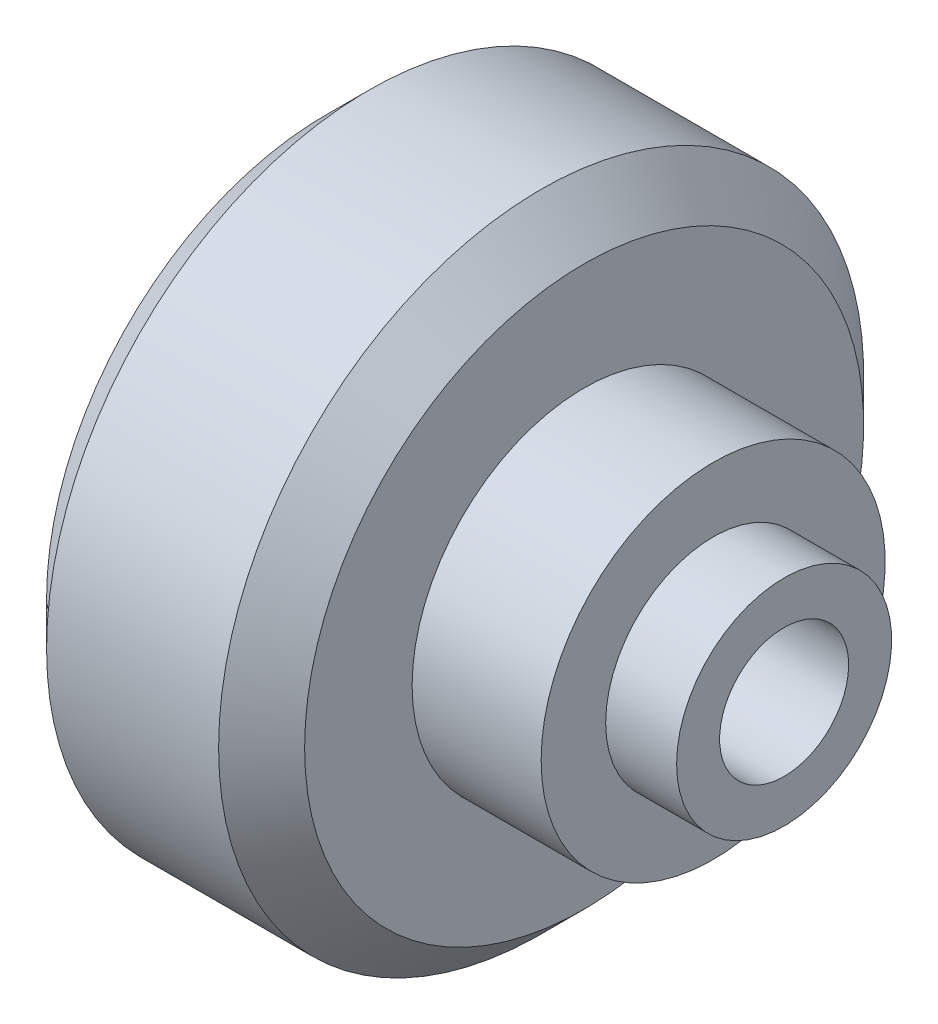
ISO-10303-21;
HEADER;
FILE_DESCRIPTION(('STEP AP214'),'2;1');
FILE_NAME('part.step','',(''),(''),'','','');
FILE_SCHEMA(('AUTOMOTIVE_DESIGN { 1 0 10303 214 1 1 1 1 }'));
ENDSEC;
DATA;
#1=APPLICATION_CONTEXT('core data for automotive mechanical design processes');
#2=APPLICATION_PROTOCOL_DEFINITION('international standard','automotive_design',2000,#1);
#3=PRODUCT_CONTEXT('',#1,'mechanical');
#4=PRODUCT('Part','Part','',(#3));
#5=PRODUCT_RELATED_PRODUCT_CATEGORY('part','',(#4));
#6=PRODUCT_DEFINITION_FORMATION('','',#4);
#7=PRODUCT_DEFINITION_CONTEXT('part definition',#1,'design');
#8=PRODUCT_DEFINITION('design','',#6,#7);
#9=PRODUCT_DEFINITION_SHAPE('','',#8);
#10=(LENGTH_UNIT() NAMED_UNIT(*) SI_UNIT(.MILLI.,.METRE.));
#11=(NAMED_UNIT(*) PLANE_ANGLE_UNIT() SI_UNIT($,.RADIAN.));
#12=(NAMED_UNIT(*) SI_UNIT($,.STERADIAN.) SOLID_ANGLE_UNIT());
#13=UNCERTAINTY_MEASURE_WITH_UNIT(LENGTH_MEASURE(1.E-05),#10,'distance_accuracy_value','');
#14=(GEOMETRIC_REPRESENTATION_CONTEXT(3) GLOBAL_UNCERTAINTY_ASSIGNED_CONTEXT((#13)) GLOBAL_UNIT_ASSIGNED_CONTEXT((#10,
#11,#12)) REPRESENTATION_CONTEXT('',''));
#15=CARTESIAN_POINT('',(0.,0.,0.));
#16=DIRECTION('',(0.,0.,1.));
#17=DIRECTION('',(1.,0.,0.));
#18=AXIS2_PLACEMENT_3D('',#15,#16,#17);
#19=CARTESIAN_POINT('',(0.,0.,0.));
#20=DIRECTION('',(1.,0.,0.));
#21=DIRECTION('',(0.,0.,-1.));
#22=AXIS2_PLACEMENT_3D('',#19,#20,#21);
#23=CYLINDRICAL_SURFACE('',#22,3.);
#24=CARTESIAN_POINT('',(21.3,0.,0.));
#25=DIRECTION('',(1.,0.,0.));
#26=DIRECTION('',(0.,0.,-1.));
#27=AXIS2_PLACEMENT_3D('',#24,#25,#26);
#28=CIRCLE('',#27,3.);
#29=CARTESIAN_POINT('',(21.3,0.,-3.));
#30=VERTEX_POINT('',#29);
#31=EDGE_CURVE('E60',#30,#30,#28,.T.);
#32=ORIENTED_EDGE('',*,*,#31,.T.);
#33=EDGE_LOOP('',(#32));
#34=FACE_BOUND('',#33,.T.);
#35=CARTESIAN_POINT('',(5.,0.,0.));
#36=DIRECTION('',(-1.,0.,0.));
#37=DIRECTION('',(0.,0.,1.));
#38=AXIS2_PLACEMENT_3D('',#35,#36,#37);
#39=CIRCLE('',#38,3.);
#40=CARTESIAN_POINT('',(5.,0.,3.));
#41=VERTEX_POINT('',#40);
#42=EDGE_CURVE('E32',#41,#41,#39,.F.);
#43=ORIENTED_EDGE('',*,*,#42,.F.);
#44=EDGE_LOOP('',(#43));
#45=FACE_BOUND('',#44,.T.);
#46=ADVANCED_FACE('F28',(#34,#45),#23,.F.);
#47=CARTESIAN_POINT('',(0.,0.,-13.));
#48=DIRECTION('',(1.,0.,0.));
#49=DIRECTION('',(0.,0.,-1.));
#50=AXIS2_PLACEMENT_3D('',#47,#48,#49);
#51=PLANE('',#50);
#52=CARTESIAN_POINT('',(0.,0.,0.));
#53=DIRECTION('',(-1.,0.,0.));
#54=DIRECTION('',(0.,0.,1.));
#55=AXIS2_PLACEMENT_3D('',#52,#53,#54);
#56=CIRCLE('',#55,8.);
#57=CARTESIAN_POINT('',(0.,0.,8.));
#58=VERTEX_POINT('',#57);
#59=EDGE_CURVE('E66',#58,#58,#56,.T.);
#60=ORIENTED_EDGE('',*,*,#59,.F.);
#61=EDGE_LOOP('',(#60));
#62=FACE_BOUND('',#61,.T.);
#63=CARTESIAN_POINT('',(0.,0.,0.));
#64=DIRECTION('',(-1.,0.,0.));
#65=DIRECTION('',(0.,0.,1.));
#66=AXIS2_PLACEMENT_3D('',#63,#64,#65);
#67=CIRCLE('',#66,13.);
#68=CARTESIAN_POINT('',(0.,0.,13.));
#69=VERTEX_POINT('',#68);
#70=EDGE_CURVE('E57',#69,#69,#67,.T.);
#71=ORIENTED_EDGE('',*,*,#70,.T.);
#72=EDGE_LOOP('',(#71));
#73=FACE_BOUND('',#72,.T.);
#74=ADVANCED_FACE('F30',(#62,#73),#51,.F.);
#75=CARTESIAN_POINT('',(21.3,0.,0.));
#76=DIRECTION('',(-1.,0.,0.));
#77=DIRECTION('',(0.,0.,1.));
#78=AXIS2_PLACEMENT_3D('',#75,#76,#77);
#79=PLANE('',#78);
#80=ORIENTED_EDGE('',*,*,#31,.F.);
#81=EDGE_LOOP('',(#80));
#82=FACE_BOUND('',#81,.T.);
#83=CARTESIAN_POINT('',(21.3,0.,0.));
#84=DIRECTION('',(-1.,0.,0.));
#85=DIRECTION('',(0.,0.,1.));
#86=AXIS2_PLACEMENT_3D('',#83,#84,#85);
#87=CIRCLE('',#86,5.);
#88=CARTESIAN_POINT('',(21.3,0.,5.));
#89=VERTEX_POINT('',#88);
#90=EDGE_CURVE('E10',#89,#89,#87,.T.);
#91=ORIENTED_EDGE('',*,*,#90,.F.);
#92=EDGE_LOOP('',(#91));
#93=FACE_BOUND('',#92,.T.);
#94=ADVANCED_FACE('F74',(#82,#93),#79,.F.);
#95=CARTESIAN_POINT('',(0.,0.,0.));
#96=DIRECTION('',(-1.,0.,0.));
#97=DIRECTION('',(0.,0.,1.));
#98=AXIS2_PLACEMENT_3D('',#95,#96,#97);
#99=CYLINDRICAL_SURFACE('',#98,5.);
#100=CARTESIAN_POINT('',(18.,0.,0.));
#101=DIRECTION('',(-1.,0.,0.));
#102=DIRECTION('',(0.,0.,1.));
#103=AXIS2_PLACEMENT_3D('',#100,#101,#102);
#104=CIRCLE('',#103,5.);
#105=CARTESIAN_POINT('',(18.,0.,5.));
#106=VERTEX_POINT('',#105);
#107=EDGE_CURVE('E36',#106,#106,#104,.T.);
#108=ORIENTED_EDGE('',*,*,#107,.F.);
#109=EDGE_LOOP('',(#108));
#110=FACE_BOUND('',#109,.T.);
#111=ORIENTED_EDGE('',*,*,#90,.T.);
#112=EDGE_LOOP('',(#111));
#113=FACE_BOUND('',#112,.T.);
#114=ADVANCED_FACE('F111',(#110,#113),#99,.T.);
#115=CARTESIAN_POINT('',(18.,0.,-5.));
#116=DIRECTION('',(-1.,0.,0.));
#117=DIRECTION('',(0.,0.,1.));
#118=AXIS2_PLACEMENT_3D('',#115,#116,#117);
#119=PLANE('',#118);
#120=CARTESIAN_POINT('',(18.,0.,0.));
#121=DIRECTION('',(-1.,0.,0.));
#122=DIRECTION('',(0.,0.,1.));
#123=AXIS2_PLACEMENT_3D('',#120,#121,#122);
#124=CIRCLE('',#123,8.);
#125=CARTESIAN_POINT('',(18.,0.,8.));
#126=VERTEX_POINT('',#125);
#127=EDGE_CURVE('E40',#126,#126,#124,.T.);
#128=ORIENTED_EDGE('',*,*,#127,.F.);
#129=EDGE_LOOP('',(#128));
#130=FACE_BOUND('',#129,.T.);
#131=ORIENTED_EDGE('',*,*,#107,.T.);
#132=EDGE_LOOP('',(#131));
#133=FACE_BOUND('',#132,.T.);
#134=ADVANCED_FACE('F105',(#130,#133),#119,.F.);
#135=CARTESIAN_POINT('',(0.,0.,0.));
#136=DIRECTION('',(-1.,0.,0.));
#137=DIRECTION('',(0.,0.,1.));
#138=AXIS2_PLACEMENT_3D('',#135,#136,#137);
#139=CYLINDRICAL_SURFACE('',#138,8.);
#140=CARTESIAN_POINT('',(12.,0.,0.));
#141=DIRECTION('',(-1.,0.,0.));
#142=DIRECTION('',(0.,0.,1.));
#143=AXIS2_PLACEMENT_3D('',#140,#141,#142);
#144=CIRCLE('',#143,8.);
#145=CARTESIAN_POINT('',(12.,0.,8.));
#146=VERTEX_POINT('',#145);
#147=EDGE_CURVE('E45',#146,#146,#144,.T.);
#148=ORIENTED_EDGE('',*,*,#147,.F.);
#149=EDGE_LOOP('',(#148));
#150=FACE_BOUND('',#149,.T.);
#151=ORIENTED_EDGE('',*,*,#127,.T.);
#152=EDGE_LOOP('',(#151));
#153=FACE_BOUND('',#152,.T.);
#154=ADVANCED_FACE('F99',(#150,#153),#139,.T.);
#155=CARTESIAN_POINT('',(12.,0.,-8.));
#156=DIRECTION('',(-1.,0.,0.));
#157=DIRECTION('',(0.,0.,1.));
#158=AXIS2_PLACEMENT_3D('',#155,#156,#157);
#159=PLANE('',#158);
#160=CARTESIAN_POINT('',(12.,0.,0.));
#161=DIRECTION('',(-1.,0.,0.));
#162=DIRECTION('',(0.,0.,1.));
#163=AXIS2_PLACEMENT_3D('',#160,#161,#162);
#164=CIRCLE('',#163,13.);
#165=CARTESIAN_POINT('',(12.,0.,13.));
#166=VERTEX_POINT('',#165);
#167=EDGE_CURVE('E48',#166,#166,#164,.T.);
#168=ORIENTED_EDGE('',*,*,#167,.F.);
#169=EDGE_LOOP('',(#168));
#170=FACE_BOUND('',#169,.T.);
#171=ORIENTED_EDGE('',*,*,#147,.T.);
#172=EDGE_LOOP('',(#171));
#173=FACE_BOUND('',#172,.T.);
#174=ADVANCED_FACE('F93',(#170,#173),#159,.F.);
#175=CARTESIAN_POINT('',(12.,0.,0.));
#176=DIRECTION('',(-1.,0.,0.));
#177=DIRECTION('',(0.,0.,1.));
#178=AXIS2_PLACEMENT_3D('',#175,#176,#177);
#179=CONICAL_SURFACE('',#178,13.,0.785398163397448);
#180=CARTESIAN_POINT('',(10.,0.,0.));
#181=DIRECTION('',(-1.,0.,0.));
#182=DIRECTION('',(0.,0.,1.));
#183=AXIS2_PLACEMENT_3D('',#180,#181,#182);
#184=CIRCLE('',#183,15.);
#185=CARTESIAN_POINT('',(10.,0.,15.));
#186=VERTEX_POINT('',#185);
#187=EDGE_CURVE('E51',#186,#186,#184,.T.);
#188=ORIENTED_EDGE('',*,*,#187,.F.);
#189=EDGE_LOOP('',(#188));
#190=FACE_BOUND('',#189,.T.);
#191=ORIENTED_EDGE('',*,*,#167,.T.);
#192=EDGE_LOOP('',(#191));
#193=FACE_BOUND('',#192,.T.);
#194=ADVANCED_FACE('F87',(#190,#193),#179,.T.);
#195=CARTESIAN_POINT('',(0.,0.,0.));
#196=DIRECTION('',(-1.,0.,0.));
#197=DIRECTION('',(0.,0.,1.));
#198=AXIS2_PLACEMENT_3D('',#195,#196,#197);
#199=CYLINDRICAL_SURFACE('',#198,15.);
#200=CARTESIAN_POINT('',(2.,0.,0.));
#201=DIRECTION('',(-1.,0.,0.));
#202=DIRECTION('',(0.,0.,1.));
#203=AXIS2_PLACEMENT_3D('',#200,#201,#202);
#204=CIRCLE('',#203,15.);
#205=CARTESIAN_POINT('',(2.,0.,15.));
#206=VERTEX_POINT('',#205);
#207=EDGE_CURVE('E54',#206,#206,#204,.T.);
#208=ORIENTED_EDGE('',*,*,#207,.F.);
#209=EDGE_LOOP('',(#208));
#210=FACE_BOUND('',#209,.T.);
#211=ORIENTED_EDGE('',*,*,#187,.T.);
#212=EDGE_LOOP('',(#211));
#213=FACE_BOUND('',#212,.T.);
#214=ADVANCED_FACE('F81',(#210,#213),#199,.T.);
#215=CARTESIAN_POINT('',(2.,0.,0.));
#216=DIRECTION('',(1.,0.,0.));
#217=DIRECTION('',(0.,0.,-1.));
#218=AXIS2_PLACEMENT_3D('',#215,#216,#217);
#219=CONICAL_SURFACE('',#218,15.,0.785398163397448);
#220=ORIENTED_EDGE('',*,*,#70,.F.);
#221=EDGE_LOOP('',(#220));
#222=FACE_BOUND('',#221,.T.);
#223=ORIENTED_EDGE('',*,*,#207,.T.);
#224=EDGE_LOOP('',(#223));
#225=FACE_BOUND('',#224,.T.);
#226=ADVANCED_FACE('F77',(#222,#225),#219,.T.);
#227=CARTESIAN_POINT('',(5.,0.,0.));
#228=DIRECTION('',(-1.,0.,0.));
#229=DIRECTION('',(0.,0.,1.));
#230=AXIS2_PLACEMENT_3D('',#227,#228,#229);
#231=PLANE('',#230);
#232=CARTESIAN_POINT('',(5.,0.,0.));
#233=DIRECTION('',(-1.,0.,0.));
#234=DIRECTION('',(0.,0.,1.));
#235=AXIS2_PLACEMENT_3D('',#232,#233,#234);
#236=CIRCLE('',#235,8.);
#237=CARTESIAN_POINT('',(5.,0.,8.));
#238=VERTEX_POINT('',#237);
#239=EDGE_CURVE('E63',#238,#238,#236,.T.);
#240=ORIENTED_EDGE('',*,*,#239,.T.);
#241=EDGE_LOOP('',(#240));
#242=FACE_BOUND('',#241,.T.);
#243=ORIENTED_EDGE('',*,*,#42,.T.);
#244=EDGE_LOOP('',(#243));
#245=FACE_BOUND('',#244,.T.);
#246=ADVANCED_FACE('F80',(#242,#245),#231,.T.);
#247=CARTESIAN_POINT('',(5.,0.,0.));
#248=DIRECTION('',(-1.,0.,0.));
#249=DIRECTION('',(0.,0.,1.));
#250=AXIS2_PLACEMENT_3D('',#247,#248,#249);
#251=CYLINDRICAL_SURFACE('',#250,8.);
#252=ORIENTED_EDGE('',*,*,#239,.F.);
#253=EDGE_LOOP('',(#252));
#254=FACE_BOUND('',#253,.T.);
#255=ORIENTED_EDGE('',*,*,#59,.T.);
#256=EDGE_LOOP('',(#255));
#257=FACE_BOUND('',#256,.T.);
#258=ADVANCED_FACE('F70',(#254,#257),#251,.F.);
#259=CLOSED_SHELL('',(#46,#74,#94,#114,#134,#154,#174,#194,#214,#226,#246,#258));
#260=MANIFOLD_SOLID_BREP('B2',#259);
#261=ADVANCED_BREP_SHAPE_REPRESENTATION('',(#18,#260),#14);
#262=SHAPE_DEFINITION_REPRESENTATION(#9,#261);
ENDSEC;
END-ISO-10303-21;
